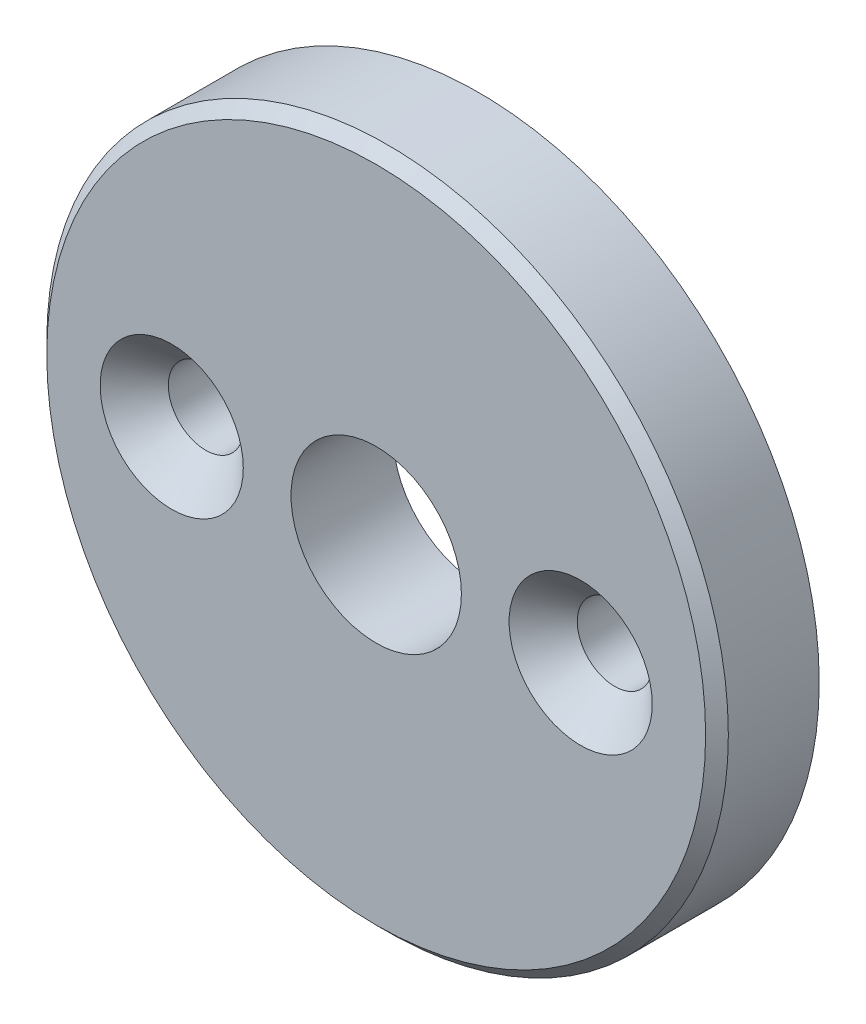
from build123d import *

# Parameters (mm, degrees)
ESQUISSE1_R                                    = 30
ESQUISSE1_R_2                                  = 7.5
EXTRUSION1_DEPTH                               = 9
CHANFREIN1_SIZE                                = 1
FRAISAGE_POUR_VIS_T_TE_FRAIS_E_M61_D           = 6.6
FRAISAGE_POUR_VIS_T_TE_FRAIS_E_M61_CSINK_D     = 12.6
FRAISAGE_POUR_VIS_T_TE_FRAIS_E_M61_CSINK_ANGLE = 90


with BuildPart() as part:
    # Esquisse1 → Extrusion1 (new body)
    with BuildSketch(Plane.XY):
        Circle(ESQUISSE1_R)
        Circle(ESQUISSE1_R_2, mode=Mode.SUBTRACT)
    extrude(amount=EXTRUSION1_DEPTH)

    # Chanfrein1
    chanfrein1_edges = [part.edges().sort_by_distance(p)[0] for p in [
        (-30, 0, 9),
    ]]
    chamfer(chanfrein1_edges, length=CHANFREIN1_SIZE)

    # Fraisage pour vis _ t_te frais_e M61 (through all)
    with Locations(Plane.XY.offset(9)):
        with Locations((-18, 0)):
            fraisage_pour_vis_t_te_frais_e_m61 = CounterSinkHole(FRAISAGE_POUR_VIS_T_TE_FRAIS_E_M61_D / 2, FRAISAGE_POUR_VIS_T_TE_FRAIS_E_M61_CSINK_D / 2, counter_sink_angle=FRAISAGE_POUR_VIS_T_TE_FRAIS_E_M61_CSINK_ANGLE)

    # Sym_trie1: Fraisage pour vis _ t_te frais_e M61 across plane
    add(fraisage_pour_vis_t_te_frais_e_m61.mirror(Plane(origin=(0, 0, 0), x_dir=(0, 0, 1), z_dir=(1, 0, 0))), mode=Mode.SUBTRACT)


solid = part.part
